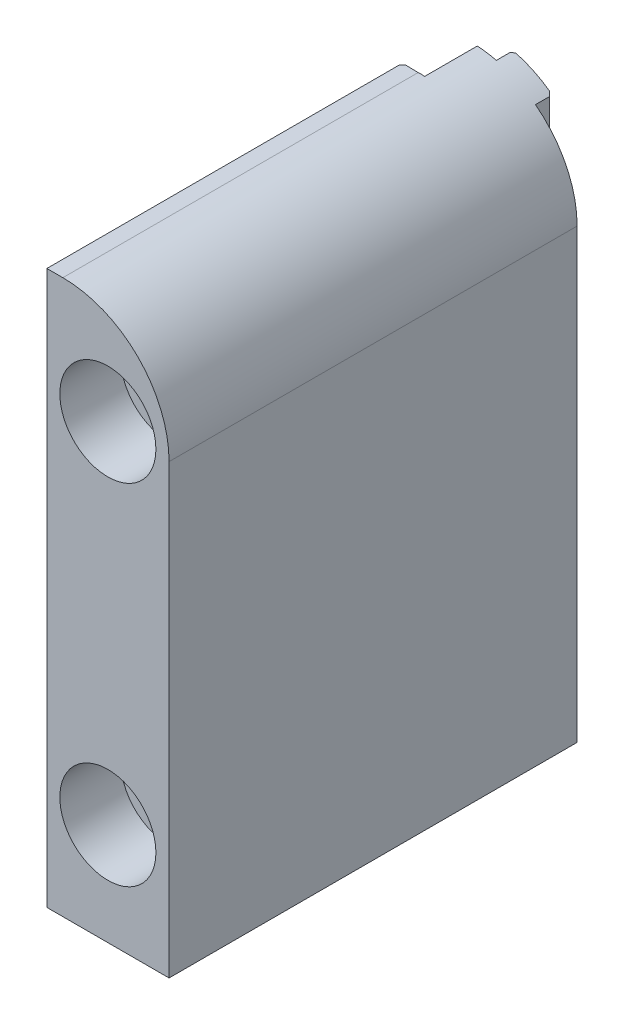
ISO-10303-21;
HEADER;
FILE_DESCRIPTION(('STEP AP214'),'2;1');
FILE_NAME('part.step','',(''),(''),'','','');
FILE_SCHEMA(('AUTOMOTIVE_DESIGN { 1 0 10303 214 1 1 1 1 }'));
ENDSEC;
DATA;
#1=APPLICATION_CONTEXT('core data for automotive mechanical design processes');
#2=APPLICATION_PROTOCOL_DEFINITION('international standard','automotive_design',2000,#1);
#3=PRODUCT_CONTEXT('',#1,'mechanical');
#4=PRODUCT('Part','Part','',(#3));
#5=PRODUCT_RELATED_PRODUCT_CATEGORY('part','',(#4));
#6=PRODUCT_DEFINITION_FORMATION('','',#4);
#7=PRODUCT_DEFINITION_CONTEXT('part definition',#1,'design');
#8=PRODUCT_DEFINITION('design','',#6,#7);
#9=PRODUCT_DEFINITION_SHAPE('','',#8);
#10=(LENGTH_UNIT() NAMED_UNIT(*) SI_UNIT(.MILLI.,.METRE.));
#11=(NAMED_UNIT(*) PLANE_ANGLE_UNIT() SI_UNIT($,.RADIAN.));
#12=(NAMED_UNIT(*) SI_UNIT($,.STERADIAN.) SOLID_ANGLE_UNIT());
#13=UNCERTAINTY_MEASURE_WITH_UNIT(LENGTH_MEASURE(1.E-05),#10,'distance_accuracy_value','');
#14=(GEOMETRIC_REPRESENTATION_CONTEXT(3) GLOBAL_UNCERTAINTY_ASSIGNED_CONTEXT((#13)) GLOBAL_UNIT_ASSIGNED_CONTEXT((#10,
#11,#12)) REPRESENTATION_CONTEXT('',''));
#15=CARTESIAN_POINT('',(0.,0.,0.));
#16=DIRECTION('',(0.,0.,1.));
#17=DIRECTION('',(1.,0.,0.));
#18=AXIS2_PLACEMENT_3D('',#15,#16,#17);
#19=CARTESIAN_POINT('',(7.32028,25.146,-37.084));
#20=DIRECTION('',(0.,0.,-1.));
#21=DIRECTION('',(-1.,0.,0.));
#22=AXIS2_PLACEMENT_3D('',#19,#20,#21);
#23=PLANE('',#22);
#24=CARTESIAN_POINT('',(5.54228,-15.875,-37.084));
#25=DIRECTION('',(0.,0.,1.));
#26=DIRECTION('',(1.,0.,0.));
#27=AXIS2_PLACEMENT_3D('',#24,#25,#26);
#28=CIRCLE('',#27,2.7051);
#29=CARTESIAN_POINT('',(8.24738,-15.875,-37.084));
#30=VERTEX_POINT('',#29);
#31=EDGE_CURVE('E457',#30,#30,#28,.T.);
#32=ORIENTED_EDGE('',*,*,#31,.T.);
#33=EDGE_LOOP('',(#32));
#34=FACE_BOUND('',#33,.T.);
#35=CARTESIAN_POINT('',(5.54228,15.875,-37.084));
#36=DIRECTION('',(0.,0.,1.));
#37=DIRECTION('',(1.,0.,0.));
#38=AXIS2_PLACEMENT_3D('',#35,#36,#37);
#39=CIRCLE('',#38,2.7051);
#40=CARTESIAN_POINT('',(8.24738,15.875,-37.084));
#41=VERTEX_POINT('',#40);
#42=EDGE_CURVE('E460',#41,#41,#39,.T.);
#43=ORIENTED_EDGE('',*,*,#42,.T.);
#44=EDGE_LOOP('',(#43));
#45=FACE_BOUND('',#44,.T.);
#46=DIRECTION('',(-0.999999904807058,0.000436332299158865,0.));
#47=VECTOR('',#46,1.);
#48=CARTESIAN_POINT('',(7.31623442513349,15.8742259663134,-37.084));
#49=LINE('',#48,#47);
#50=CARTESIAN_POINT('',(8.71753369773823,15.8736145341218,-37.084));
#51=VERTEX_POINT('',#50);
#52=CARTESIAN_POINT('',(8.71727969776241,15.8736146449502,-37.084));
#53=VERTEX_POINT('',#52);
#54=EDGE_CURVE('E252',#51,#53,#49,.T.);
#55=ORIENTED_EDGE('',*,*,#54,.T.);
#56=CARTESIAN_POINT('',(5.54228,15.875,-37.084));
#57=DIRECTION('',(0.,0.,-1.));
#58=DIRECTION('',(-1.,0.,0.));
#59=AXIS2_PLACEMENT_3D('',#56,#57,#58);
#60=CIRCLE('',#59,3.175);
#61=CARTESIAN_POINT('',(8.71728,15.875,-37.084));
#62=VERTEX_POINT('',#61);
#63=EDGE_CURVE('E296',#53,#62,#60,.T.);
#64=ORIENTED_EDGE('',*,*,#63,.T.);
#65=DIRECTION('',(-1.,0.,0.));
#66=VECTOR('',#65,1.);
#67=CARTESIAN_POINT('',(7.32028,15.875,-37.084));
#68=LINE('',#67,#66);
#69=CARTESIAN_POINT('',(8.717534,15.875,-37.084));
#70=VERTEX_POINT('',#69);
#71=EDGE_CURVE('E607',#62,#70,#68,.F.);
#72=ORIENTED_EDGE('',*,*,#71,.T.);
#73=CARTESIAN_POINT('',(5.54228,15.875,-37.084));
#74=DIRECTION('',(0.,0.,-1.));
#75=DIRECTION('',(-1.,0.,0.));
#76=AXIS2_PLACEMENT_3D('',#73,#74,#75);
#77=CIRCLE('',#76,3.175254);
#78=CARTESIAN_POINT('',(7.32028,18.5057706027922,-37.084));
#79=VERTEX_POINT('',#78);
#80=EDGE_CURVE('E588',#79,#70,#77,.T.);
#81=ORIENTED_EDGE('',*,*,#80,.F.);
#82=DIRECTION('',(0.,-1.,0.));
#83=VECTOR('',#82,1.);
#84=CARTESIAN_POINT('',(7.32028,25.146,-37.084));
#85=LINE('',#84,#83);
#86=CARTESIAN_POINT('',(7.32028,23.1578581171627,-37.084));
#87=VERTEX_POINT('',#86);
#88=EDGE_CURVE('E275',#87,#79,#85,.T.);
#89=ORIENTED_EDGE('',*,*,#88,.F.);
#90=CARTESIAN_POINT('',(1.45288,15.494,-37.084));
#91=DIRECTION('',(0.,0.,-1.));
#92=DIRECTION('',(-1.,0.,0.));
#93=AXIS2_PLACEMENT_3D('',#90,#91,#92);
#94=CIRCLE('',#93,9.652);
#95=CARTESIAN_POINT('',(11.10488,15.494,-37.084));
#96=VERTEX_POINT('',#95);
#97=EDGE_CURVE('E489',#87,#96,#94,.T.);
#98=ORIENTED_EDGE('',*,*,#97,.T.);
#99=DIRECTION('',(0.,-1.,0.));
#100=VECTOR('',#99,1.);
#101=CARTESIAN_POINT('',(11.10488,25.146,-37.084));
#102=LINE('',#101,#100);
#103=CARTESIAN_POINT('',(11.10488,-25.146,-37.084));
#104=VERTEX_POINT('',#103);
#105=EDGE_CURVE('E278',#96,#104,#102,.T.);
#106=ORIENTED_EDGE('',*,*,#105,.T.);
#107=DIRECTION('',(1.,0.,0.));
#108=VECTOR('',#107,1.);
#109=CARTESIAN_POINT('',(7.32028,-25.146,-37.084));
#110=LINE('',#109,#108);
#111=CARTESIAN_POINT('',(7.32028,-25.146,-37.084));
#112=VERTEX_POINT('',#111);
#113=EDGE_CURVE('E476',#112,#104,#110,.T.);
#114=ORIENTED_EDGE('',*,*,#113,.F.);
#115=CARTESIAN_POINT('',(7.32028,-18.5057706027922,-37.084));
#116=VERTEX_POINT('',#115);
#117=EDGE_CURVE('E276',#116,#112,#85,.T.);
#118=ORIENTED_EDGE('',*,*,#117,.F.);
#119=CARTESIAN_POINT('',(5.54228,-15.875,-37.084));
#120=DIRECTION('',(0.,0.,-1.));
#121=DIRECTION('',(-1.,0.,0.));
#122=AXIS2_PLACEMENT_3D('',#119,#120,#121);
#123=CIRCLE('',#122,3.175254);
#124=CARTESIAN_POINT('',(8.71753369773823,-15.8763854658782,-37.084));
#125=VERTEX_POINT('',#124);
#126=EDGE_CURVE('E425',#125,#116,#123,.T.);
#127=ORIENTED_EDGE('',*,*,#126,.F.);
#128=DIRECTION('',(-0.999999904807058,0.000436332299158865,0.));
#129=VECTOR('',#128,1.);
#130=CARTESIAN_POINT('',(7.30238087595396,-15.8757679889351,-37.084));
#131=LINE('',#130,#129);
#132=CARTESIAN_POINT('',(8.71727969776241,-15.8763853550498,-37.084));
#133=VERTEX_POINT('',#132);
#134=EDGE_CURVE('E444',#125,#133,#131,.T.);
#135=ORIENTED_EDGE('',*,*,#134,.T.);
#136=CARTESIAN_POINT('',(5.54228,-15.875,-37.084));
#137=DIRECTION('',(0.,0.,-1.));
#138=DIRECTION('',(-1.,0.,0.));
#139=AXIS2_PLACEMENT_3D('',#136,#137,#138);
#140=CIRCLE('',#139,3.175);
#141=CARTESIAN_POINT('',(8.71728,-15.875,-37.084));
#142=VERTEX_POINT('',#141);
#143=EDGE_CURVE('E455',#133,#142,#140,.T.);
#144=ORIENTED_EDGE('',*,*,#143,.T.);
#145=DIRECTION('',(-1.,0.,0.));
#146=VECTOR('',#145,1.);
#147=CARTESIAN_POINT('',(7.32028,-15.875,-37.084));
#148=LINE('',#147,#146);
#149=CARTESIAN_POINT('',(8.717534,-15.875,-37.084));
#150=VERTEX_POINT('',#149);
#151=EDGE_CURVE('E447',#142,#150,#148,.F.);
#152=ORIENTED_EDGE('',*,*,#151,.T.);
#153=CARTESIAN_POINT('',(7.32028,-13.2442293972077,-37.084));
#154=VERTEX_POINT('',#153);
#155=EDGE_CURVE('E424',#154,#150,#123,.T.);
#156=ORIENTED_EDGE('',*,*,#155,.F.);
#157=CARTESIAN_POINT('',(7.32028,13.2442293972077,-37.084));
#158=VERTEX_POINT('',#157);
#159=EDGE_CURVE('E19',#158,#154,#85,.T.);
#160=ORIENTED_EDGE('',*,*,#159,.F.);
#161=EDGE_CURVE('E591',#51,#158,#77,.T.);
#162=ORIENTED_EDGE('',*,*,#161,.F.);
#163=EDGE_LOOP('',(#55,#64,#72,#81,#89,#98,#106,#114,#118,#127,#135,#144,#152,#156,#160,#162));
#164=FACE_BOUND('',#163,.T.);
#165=ADVANCED_FACE('F15',(#34,#45,#164),#23,.T.);
#166=CARTESIAN_POINT('',(5.54228,15.875,-26.6446));
#167=DIRECTION('',(0.,0.,1.));
#168=DIRECTION('',(-1.,0.,0.));
#169=AXIS2_PLACEMENT_3D('',#166,#167,#168);
#170=CONICAL_SURFACE('',#169,3.3147,0.785398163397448);
#171=CARTESIAN_POINT('',(5.54228,15.875,-27.2542));
#172=DIRECTION('',(0.,0.,-1.));
#173=DIRECTION('',(-1.,0.,0.));
#174=AXIS2_PLACEMENT_3D('',#171,#172,#173);
#175=CIRCLE('',#174,2.7051);
#176=CARTESIAN_POINT('',(2.83718,15.875,-27.2542));
#177=VERTEX_POINT('',#176);
#178=EDGE_CURVE('E300',#177,#177,#175,.T.);
#179=ORIENTED_EDGE('',*,*,#178,.T.);
#180=EDGE_LOOP('',(#179));
#181=FACE_BOUND('',#180,.T.);
#182=CARTESIAN_POINT('',(5.54228,15.875,-26.6446));
#183=DIRECTION('',(0.,0.,1.));
#184=DIRECTION('',(1.,0.,0.));
#185=AXIS2_PLACEMENT_3D('',#182,#183,#184);
#186=CIRCLE('',#185,3.3147);
#187=CARTESIAN_POINT('',(8.85698,15.875,-26.6446));
#188=VERTEX_POINT('',#187);
#189=EDGE_CURVE('E333',#188,#188,#186,.T.);
#190=ORIENTED_EDGE('',*,*,#189,.T.);
#191=EDGE_LOOP('',(#190));
#192=FACE_BOUND('',#191,.T.);
#193=CARTESIAN_POINT('',(5.54228,15.875,-26.7843));
#194=DIRECTION('',(0.,0.,1.));
#195=DIRECTION('',(1.,0.,0.));
#196=AXIS2_PLACEMENT_3D('',#193,#194,#195);
#197=CIRCLE('',#196,3.175);
#198=CARTESIAN_POINT('',(8.71727969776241,15.8736146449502,-26.7843));
#199=VERTEX_POINT('',#198);
#200=CARTESIAN_POINT('',(8.71728,15.875,-26.7843));
#201=VERTEX_POINT('',#200);
#202=EDGE_CURVE('E9',#199,#201,#197,.F.);
#203=ORIENTED_EDGE('',*,*,#202,.F.);
#204=DIRECTION('',(0.707106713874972,-0.000308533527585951,0.707106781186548));
#205=VECTOR('',#204,1.);
#206=CARTESIAN_POINT('',(5.54228,15.875,-29.9593));
#207=LINE('',#206,#205);
#208=CARTESIAN_POINT('',(8.71753369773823,15.8736145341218,-26.784046));
#209=VERTEX_POINT('',#208);
#210=EDGE_CURVE('E244',#209,#199,#207,.F.);
#211=ORIENTED_EDGE('',*,*,#210,.F.);
#212=CARTESIAN_POINT('',(5.54228,15.875,-26.784046));
#213=DIRECTION('',(0.,0.,1.));
#214=DIRECTION('',(1.,0.,0.));
#215=AXIS2_PLACEMENT_3D('',#212,#213,#214);
#216=CIRCLE('',#215,3.175254);
#217=CARTESIAN_POINT('',(8.717534,15.875,-26.784046));
#218=VERTEX_POINT('',#217);
#219=EDGE_CURVE('E236',#209,#218,#216,.F.);
#220=ORIENTED_EDGE('',*,*,#219,.T.);
#221=DIRECTION('',(0.707106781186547,0.,0.707106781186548));
#222=VECTOR('',#221,1.);
#223=CARTESIAN_POINT('',(5.54228,15.875,-29.9593));
#224=LINE('',#223,#222);
#225=EDGE_CURVE('E25',#201,#218,#224,.T.);
#226=ORIENTED_EDGE('',*,*,#225,.F.);
#227=EDGE_LOOP('',(#203,#211,#220,#226));
#228=FACE_BOUND('',#227,.T.);
#229=ADVANCED_FACE('F255',(#181,#192,#228),#170,.F.);
#230=CARTESIAN_POINT('',(3.76428,13.2442293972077,-37.084));
#231=VERTEX_POINT('',#230);
#232=CARTESIAN_POINT('',(3.76428,18.5057706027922,-37.084));
#233=VERTEX_POINT('',#232);
#234=EDGE_CURVE('E592',#231,#233,#77,.T.);
#235=ORIENTED_EDGE('',*,*,#234,.F.);
#236=DIRECTION('',(0.,-1.,0.));
#237=VECTOR('',#236,1.);
#238=CARTESIAN_POINT('',(3.76428,25.146,-37.084));
#239=LINE('',#238,#237);
#240=CARTESIAN_POINT('',(3.76428,-13.2442293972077,-37.084));
#241=VERTEX_POINT('',#240);
#242=EDGE_CURVE('E259',#231,#241,#239,.T.);
#243=ORIENTED_EDGE('',*,*,#242,.T.);
#244=CARTESIAN_POINT('',(3.76428,-18.5057706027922,-37.084));
#245=VERTEX_POINT('',#244);
#246=EDGE_CURVE('E419',#245,#241,#123,.T.);
#247=ORIENTED_EDGE('',*,*,#246,.F.);
#248=CARTESIAN_POINT('',(3.76428,-25.146,-37.084));
#249=VERTEX_POINT('',#248);
#250=EDGE_CURVE('E262',#245,#249,#239,.T.);
#251=ORIENTED_EDGE('',*,*,#250,.T.);
#252=DIRECTION('',(1.,0.,0.));
#253=VECTOR('',#252,1.);
#254=CARTESIAN_POINT('',(1.96088,-25.146,-37.084));
#255=LINE('',#254,#253);
#256=CARTESIAN_POINT('',(2.02438,-25.146,-37.084));
#257=VERTEX_POINT('',#256);
#258=EDGE_CURVE('E324',#257,#249,#255,.T.);
#259=ORIENTED_EDGE('',*,*,#258,.F.);
#260=DIRECTION('',(0.,-1.,0.));
#261=VECTOR('',#260,1.);
#262=CARTESIAN_POINT('',(2.02438,25.146,-37.084));
#263=LINE('',#262,#261);
#264=CARTESIAN_POINT('',(2.032,25.1286107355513,-37.084));
#265=VERTEX_POINT('',#264);
#266=EDGE_CURVE('E309',#265,#257,#263,.T.);
#267=ORIENTED_EDGE('',*,*,#266,.F.);
#268=CARTESIAN_POINT('',(1.45288,15.494,-37.084));
#269=DIRECTION('',(0.,0.,-1.));
#270=DIRECTION('',(-1.,0.,0.));
#271=AXIS2_PLACEMENT_3D('',#268,#269,#270);
#272=CIRCLE('',#271,9.652);
#273=CARTESIAN_POINT('',(3.76428,24.8651543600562,-37.084));
#274=VERTEX_POINT('',#273);
#275=EDGE_CURVE('E315',#265,#274,#272,.T.);
#276=ORIENTED_EDGE('',*,*,#275,.T.);
#277=EDGE_CURVE('E261',#274,#233,#239,.T.);
#278=ORIENTED_EDGE('',*,*,#277,.T.);
#279=EDGE_LOOP('',(#235,#243,#247,#251,#259,#267,#276,#278));
#280=FACE_BOUND('',#279,.T.);
#281=ADVANCED_FACE('F612',(#280),#23,.T.);
#282=CARTESIAN_POINT('',(5.54228,-15.875,-26.6446));
#283=DIRECTION('',(0.,0.,1.));
#284=DIRECTION('',(-1.,0.,0.));
#285=AXIS2_PLACEMENT_3D('',#282,#283,#284);
#286=CONICAL_SURFACE('',#285,3.3147,0.785398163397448);
#287=CARTESIAN_POINT('',(5.54228,-15.875,-27.2542));
#288=DIRECTION('',(0.,0.,-1.));
#289=DIRECTION('',(-1.,0.,0.));
#290=AXIS2_PLACEMENT_3D('',#287,#288,#289);
#291=CIRCLE('',#290,2.7051);
#292=CARTESIAN_POINT('',(2.83718,-15.875,-27.2542));
#293=VERTEX_POINT('',#292);
#294=EDGE_CURVE('E330',#293,#293,#291,.T.);
#295=ORIENTED_EDGE('',*,*,#294,.T.);
#296=EDGE_LOOP('',(#295));
#297=FACE_BOUND('',#296,.T.);
#298=CARTESIAN_POINT('',(5.54228,-15.875,-26.6446));
#299=DIRECTION('',(0.,0.,1.));
#300=DIRECTION('',(1.,0.,0.));
#301=AXIS2_PLACEMENT_3D('',#298,#299,#300);
#302=CIRCLE('',#301,3.3147);
#303=CARTESIAN_POINT('',(8.85698,-15.875,-26.6446));
#304=VERTEX_POINT('',#303);
#305=EDGE_CURVE('E337',#304,#304,#302,.T.);
#306=ORIENTED_EDGE('',*,*,#305,.T.);
#307=EDGE_LOOP('',(#306));
#308=FACE_BOUND('',#307,.T.);
#309=CARTESIAN_POINT('',(5.54228,-15.875,-26.7843));
#310=DIRECTION('',(0.,0.,1.));
#311=DIRECTION('',(1.,0.,0.));
#312=AXIS2_PLACEMENT_3D('',#309,#310,#311);
#313=CIRCLE('',#312,3.175);
#314=CARTESIAN_POINT('',(8.71727969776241,-15.8763853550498,-26.7843));
#315=VERTEX_POINT('',#314);
#316=CARTESIAN_POINT('',(8.71728,-15.875,-26.7843));
#317=VERTEX_POINT('',#316);
#318=EDGE_CURVE('E245',#315,#317,#313,.F.);
#319=ORIENTED_EDGE('',*,*,#318,.F.);
#320=DIRECTION('',(0.707106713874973,-0.000308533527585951,0.707106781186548));
#321=VECTOR('',#320,1.);
#322=CARTESIAN_POINT('',(5.54228,-15.875,-29.9593));
#323=LINE('',#322,#321);
#324=CARTESIAN_POINT('',(8.71753369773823,-15.8763854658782,-26.784046));
#325=VERTEX_POINT('',#324);
#326=EDGE_CURVE('E283',#325,#315,#323,.F.);
#327=ORIENTED_EDGE('',*,*,#326,.F.);
#328=CARTESIAN_POINT('',(5.54228,-15.875,-26.784046));
#329=DIRECTION('',(0.,0.,1.));
#330=DIRECTION('',(1.,0.,0.));
#331=AXIS2_PLACEMENT_3D('',#328,#329,#330);
#332=CIRCLE('',#331,3.175254);
#333=CARTESIAN_POINT('',(8.717534,-15.875,-26.784046));
#334=VERTEX_POINT('',#333);
#335=EDGE_CURVE('E285',#325,#334,#332,.F.);
#336=ORIENTED_EDGE('',*,*,#335,.T.);
#337=DIRECTION('',(0.707106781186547,0.,0.707106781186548));
#338=VECTOR('',#337,1.);
#339=CARTESIAN_POINT('',(5.54228,-15.875,-29.9593));
#340=LINE('',#339,#338);
#341=EDGE_CURVE('E280',#317,#334,#340,.T.);
#342=ORIENTED_EDGE('',*,*,#341,.F.);
#343=EDGE_LOOP('',(#319,#327,#336,#342));
#344=FACE_BOUND('',#343,.T.);
#345=ADVANCED_FACE('F610',(#297,#308,#344),#286,.F.);
#346=CARTESIAN_POINT('',(3.76428,25.146,-37.084));
#347=DIRECTION('',(-1.,0.,0.));
#348=DIRECTION('',(0.,0.,1.));
#349=AXIS2_PLACEMENT_3D('',#346,#347,#348);
#350=PLANE('',#349);
#351=DIRECTION('',(0.,0.,1.));
#352=VECTOR('',#351,1.);
#353=CARTESIAN_POINT('',(3.76428,-18.5057706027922,-26.6446));
#354=LINE('',#353,#352);
#355=CARTESIAN_POINT('',(3.76428,-18.5057706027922,-38.354));
#356=VERTEX_POINT('',#355);
#357=EDGE_CURVE('E415',#356,#245,#354,.T.);
#358=ORIENTED_EDGE('',*,*,#357,.F.);
#359=DIRECTION('',(0.,1.,0.));
#360=VECTOR('',#359,1.);
#361=CARTESIAN_POINT('',(3.76428,25.146,-38.354));
#362=LINE('',#361,#360);
#363=CARTESIAN_POINT('',(3.76428,-25.146,-38.354));
#364=VERTEX_POINT('',#363);
#365=EDGE_CURVE('E350',#364,#356,#362,.T.);
#366=ORIENTED_EDGE('',*,*,#365,.F.);
#367=DIRECTION('',(0.,0.,-1.));
#368=VECTOR('',#367,1.);
#369=CARTESIAN_POINT('',(3.76428,-25.146,-37.084));
#370=LINE('',#369,#368);
#371=EDGE_CURVE('E414',#249,#364,#370,.T.);
#372=ORIENTED_EDGE('',*,*,#371,.F.);
#373=ORIENTED_EDGE('',*,*,#250,.F.);
#374=EDGE_LOOP('',(#358,#366,#372,#373));
#375=FACE_BOUND('',#374,.T.);
#376=ADVANCED_FACE('F412',(#375),#350,.T.);
#377=CARTESIAN_POINT('',(7.32028,25.146,-38.354));
#378=DIRECTION('',(-0.707106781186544,0.,0.707106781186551));
#379=DIRECTION('',(-0.707106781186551,0.,-0.707106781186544));
#380=AXIS2_PLACEMENT_3D('',#377,#378,#379);
#381=PLANE('',#380);
#382=CARTESIAN_POINT('',(5.54228,-15.875,-40.132));
#383=DIRECTION('',(-0.707106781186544,0.,0.707106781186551));
#384=DIRECTION('',(0.707106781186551,0.,0.707106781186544));
#385=AXIS2_PLACEMENT_3D('',#382,#383,#384);
#386=ELLIPSE('',#385,4.4904872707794,3.175254);
#387=CARTESIAN_POINT('',(7.32028,-18.5057706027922,-38.354));
#388=VERTEX_POINT('',#387);
#389=CARTESIAN_POINT('',(7.06628,-18.6606169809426,-38.608));
#390=VERTEX_POINT('',#389);
#391=EDGE_CURVE('E420',#388,#390,#386,.F.);
#392=ORIENTED_EDGE('',*,*,#391,.F.);
#393=DIRECTION('',(0.,-1.,0.));
#394=VECTOR('',#393,1.);
#395=CARTESIAN_POINT('',(7.32028,25.146,-38.354));
#396=LINE('',#395,#394);
#397=CARTESIAN_POINT('',(7.32028,-25.146,-38.354));
#398=VERTEX_POINT('',#397);
#399=EDGE_CURVE('E371',#388,#398,#396,.T.);
#400=ORIENTED_EDGE('',*,*,#399,.T.);
#401=DIRECTION('',(0.707106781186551,0.,0.707106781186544));
#402=VECTOR('',#401,1.);
#403=CARTESIAN_POINT('',(7.32028,-25.146,-38.354));
#404=LINE('',#403,#402);
#405=CARTESIAN_POINT('',(7.06628,-25.146,-38.608));
#406=VERTEX_POINT('',#405);
#407=EDGE_CURVE('E375',#398,#406,#404,.F.);
#408=ORIENTED_EDGE('',*,*,#407,.T.);
#409=DIRECTION('',(0.,1.,0.));
#410=VECTOR('',#409,1.);
#411=CARTESIAN_POINT('',(7.06628,25.146,-38.608));
#412=LINE('',#411,#410);
#413=EDGE_CURVE('E384',#406,#390,#412,.T.);
#414=ORIENTED_EDGE('',*,*,#413,.T.);
#415=EDGE_LOOP('',(#392,#400,#408,#414));
#416=FACE_BOUND('',#415,.T.);
#417=ADVANCED_FACE('F544',(#416),#381,.F.);
#418=CARTESIAN_POINT('',(3.76428,25.146,-38.608));
#419=DIRECTION('',(0.,0.,-1.));
#420=DIRECTION('',(-1.,0.,0.));
#421=AXIS2_PLACEMENT_3D('',#418,#419,#420);
#422=PLANE('',#421);
#423=CARTESIAN_POINT('',(5.54228,15.875,-38.608));
#424=DIRECTION('',(0.,0.,-1.));
#425=DIRECTION('',(-1.,0.,0.));
#426=AXIS2_PLACEMENT_3D('',#423,#424,#425);
#427=CIRCLE('',#426,3.175254);
#428=CARTESIAN_POINT('',(7.06628,13.0893830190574,-38.608));
#429=VERTEX_POINT('',#428);
#430=CARTESIAN_POINT('',(4.01828,13.0893830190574,-38.608));
#431=VERTEX_POINT('',#430);
#432=EDGE_CURVE('E600',#429,#431,#427,.T.);
#433=ORIENTED_EDGE('',*,*,#432,.F.);
#434=CARTESIAN_POINT('',(7.06628,-13.0893830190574,-38.608));
#435=VERTEX_POINT('',#434);
#436=EDGE_CURVE('E388',#435,#429,#412,.T.);
#437=ORIENTED_EDGE('',*,*,#436,.F.);
#438=CARTESIAN_POINT('',(5.54228,-15.875,-38.608));
#439=DIRECTION('',(0.,0.,-1.));
#440=DIRECTION('',(-1.,0.,0.));
#441=AXIS2_PLACEMENT_3D('',#438,#439,#440);
#442=CIRCLE('',#441,3.175254);
#443=CARTESIAN_POINT('',(4.01828,-13.0893830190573,-38.608));
#444=VERTEX_POINT('',#443);
#445=EDGE_CURVE('E436',#444,#435,#442,.T.);
#446=ORIENTED_EDGE('',*,*,#445,.F.);
#447=DIRECTION('',(0.,-1.,0.));
#448=VECTOR('',#447,1.);
#449=CARTESIAN_POINT('',(4.01828,25.146,-38.608));
#450=LINE('',#449,#448);
#451=EDGE_CURVE('E383',#431,#444,#450,.T.);
#452=ORIENTED_EDGE('',*,*,#451,.F.);
#453=EDGE_LOOP('',(#433,#437,#446,#452));
#454=FACE_BOUND('',#453,.T.);
#455=ADVANCED_FACE('F644',(#454),#422,.T.);
#456=CARTESIAN_POINT('',(7.32028,25.146,-38.608));
#457=DIRECTION('',(1.,0.,0.));
#458=DIRECTION('',(0.,0.,-1.));
#459=AXIS2_PLACEMENT_3D('',#456,#457,#458);
#460=PLANE('',#459);
#461=DIRECTION('',(0.,0.,1.));
#462=VECTOR('',#461,1.);
#463=CARTESIAN_POINT('',(7.32028,13.2442293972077,-26.6446));
#464=LINE('',#463,#462);
#465=CARTESIAN_POINT('',(7.32028,13.2442293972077,-38.354));
#466=VERTEX_POINT('',#465);
#467=EDGE_CURVE('E604',#158,#466,#464,.F.);
#468=ORIENTED_EDGE('',*,*,#467,.F.);
#469=ORIENTED_EDGE('',*,*,#159,.T.);
#470=DIRECTION('',(0.,0.,1.));
#471=VECTOR('',#470,1.);
#472=CARTESIAN_POINT('',(7.32028,-13.2442293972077,-26.6446));
#473=LINE('',#472,#471);
#474=CARTESIAN_POINT('',(7.32028,-13.2442293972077,-38.354));
#475=VERTEX_POINT('',#474);
#476=EDGE_CURVE('E441',#475,#154,#473,.T.);
#477=ORIENTED_EDGE('',*,*,#476,.F.);
#478=EDGE_CURVE('E370',#466,#475,#396,.T.);
#479=ORIENTED_EDGE('',*,*,#478,.F.);
#480=EDGE_LOOP('',(#468,#469,#477,#479));
#481=FACE_BOUND('',#480,.T.);
#482=ADVANCED_FACE('F642',(#481),#460,.T.);
#483=CARTESIAN_POINT('',(4.01828,25.146,-38.608));
#484=DIRECTION('',(0.707106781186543,0.,0.707106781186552));
#485=DIRECTION('',(-0.707106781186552,0.,0.707106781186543));
#486=AXIS2_PLACEMENT_3D('',#483,#484,#485);
#487=PLANE('',#486);
#488=CARTESIAN_POINT('',(5.54228,15.875,-40.132));
#489=DIRECTION('',(0.707106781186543,0.,0.707106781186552));
#490=DIRECTION('',(-0.707106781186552,0.,0.707106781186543));
#491=AXIS2_PLACEMENT_3D('',#488,#489,#490);
#492=ELLIPSE('',#491,4.4904872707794,3.175254);
#493=CARTESIAN_POINT('',(3.76428,13.2442293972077,-38.354));
#494=VERTEX_POINT('',#493);
#495=EDGE_CURVE('E598',#431,#494,#492,.F.);
#496=ORIENTED_EDGE('',*,*,#495,.F.);
#497=ORIENTED_EDGE('',*,*,#451,.T.);
#498=CARTESIAN_POINT('',(5.54228,-15.875,-40.132));
#499=DIRECTION('',(0.707106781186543,0.,0.707106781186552));
#500=DIRECTION('',(-0.707106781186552,0.,0.707106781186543));
#501=AXIS2_PLACEMENT_3D('',#498,#499,#500);
#502=ELLIPSE('',#501,4.49048727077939,3.175254);
#503=CARTESIAN_POINT('',(3.76428,-13.2442293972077,-38.354));
#504=VERTEX_POINT('',#503);
#505=EDGE_CURVE('E433',#504,#444,#502,.F.);
#506=ORIENTED_EDGE('',*,*,#505,.F.);
#507=EDGE_CURVE('E394',#504,#494,#362,.T.);
#508=ORIENTED_EDGE('',*,*,#507,.T.);
#509=EDGE_LOOP('',(#496,#497,#506,#508));
#510=FACE_BOUND('',#509,.T.);
#511=ADVANCED_FACE('F706',(#510),#487,.F.);
#512=DIRECTION('',(0.,0.,1.));
#513=VECTOR('',#512,1.);
#514=CARTESIAN_POINT('',(3.76428,13.2442293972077,-26.6446));
#515=LINE('',#514,#513);
#516=EDGE_CURVE('E596',#494,#231,#515,.T.);
#517=ORIENTED_EDGE('',*,*,#516,.F.);
#518=ORIENTED_EDGE('',*,*,#507,.F.);
#519=DIRECTION('',(0.,0.,1.));
#520=VECTOR('',#519,1.);
#521=CARTESIAN_POINT('',(3.76428,-13.2442293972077,-26.6446));
#522=LINE('',#521,#520);
#523=EDGE_CURVE('E431',#241,#504,#522,.F.);
#524=ORIENTED_EDGE('',*,*,#523,.F.);
#525=ORIENTED_EDGE('',*,*,#242,.F.);
#526=EDGE_LOOP('',(#517,#518,#524,#525));
#527=FACE_BOUND('',#526,.T.);
#528=ADVANCED_FACE('F621',(#527),#350,.T.);
#529=CARTESIAN_POINT('',(5.54228,15.875,-38.608));
#530=DIRECTION('',(0.,0.,-1.));
#531=DIRECTION('',(-1.,0.,0.));
#532=AXIS2_PLACEMENT_3D('',#529,#530,#531);
#533=CIRCLE('',#532,3.175254);
#534=CARTESIAN_POINT('',(4.01828,18.6606169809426,-38.608));
#535=VERTEX_POINT('',#534);
#536=CARTESIAN_POINT('',(7.06628,18.6606169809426,-38.608));
#537=VERTEX_POINT('',#536);
#538=EDGE_CURVE('E33',#535,#537,#533,.T.);
#539=ORIENTED_EDGE('',*,*,#538,.F.);
#540=CARTESIAN_POINT('',(4.01828,24.7988281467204,-38.608));
#541=VERTEX_POINT('',#540);
#542=EDGE_CURVE('E379',#541,#535,#450,.T.);
#543=ORIENTED_EDGE('',*,*,#542,.F.);
#544=CARTESIAN_POINT('',(1.45288,15.494,-38.608));
#545=DIRECTION('',(0.,0.,-1.));
#546=DIRECTION('',(-1.,0.,0.));
#547=AXIS2_PLACEMENT_3D('',#544,#545,#546);
#548=CIRCLE('',#547,9.652);
#549=CARTESIAN_POINT('',(7.06628,23.3458051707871,-38.608));
#550=VERTEX_POINT('',#549);
#551=EDGE_CURVE('E548',#541,#550,#548,.T.);
#552=ORIENTED_EDGE('',*,*,#551,.T.);
#553=EDGE_CURVE('E382',#537,#550,#412,.T.);
#554=ORIENTED_EDGE('',*,*,#553,.F.);
#555=EDGE_LOOP('',(#539,#543,#552,#554));
#556=FACE_BOUND('',#555,.T.);
#557=ADVANCED_FACE('F566',(#556),#422,.T.);
#558=DIRECTION('',(0.,0.,1.));
#559=VECTOR('',#558,1.);
#560=CARTESIAN_POINT('',(7.32028,18.5057706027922,-26.6446));
#561=LINE('',#560,#559);
#562=CARTESIAN_POINT('',(7.32028,18.5057706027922,-38.354));
#563=VERTEX_POINT('',#562);
#564=EDGE_CURVE('E576',#563,#79,#561,.T.);
#565=ORIENTED_EDGE('',*,*,#564,.F.);
#566=CARTESIAN_POINT('',(7.32028,23.1578581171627,-38.354));
#567=VERTEX_POINT('',#566);
#568=EDGE_CURVE('E366',#567,#563,#396,.T.);
#569=ORIENTED_EDGE('',*,*,#568,.F.);
#570=DIRECTION('',(0.,0.,1.));
#571=VECTOR('',#570,1.);
#572=CARTESIAN_POINT('',(7.32028,23.1578581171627,-38.608));
#573=LINE('',#572,#571);
#574=EDGE_CURVE('E545',#567,#87,#573,.T.);
#575=ORIENTED_EDGE('',*,*,#574,.T.);
#576=ORIENTED_EDGE('',*,*,#88,.T.);
#577=EDGE_LOOP('',(#565,#569,#575,#576));
#578=FACE_BOUND('',#577,.T.);
#579=ADVANCED_FACE('F575',(#578),#460,.T.);
#580=CARTESIAN_POINT('',(5.54228,15.875,-40.132));
#581=DIRECTION('',(-0.707106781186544,0.,0.707106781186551));
#582=DIRECTION('',(0.707106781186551,0.,0.707106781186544));
#583=AXIS2_PLACEMENT_3D('',#580,#581,#582);
#584=ELLIPSE('',#583,4.4904872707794,3.175254);
#585=EDGE_CURVE('E602',#466,#429,#584,.F.);
#586=ORIENTED_EDGE('',*,*,#585,.F.);
#587=ORIENTED_EDGE('',*,*,#478,.T.);
#588=CARTESIAN_POINT('',(5.54228,-15.875,-40.132));
#589=DIRECTION('',(-0.707106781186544,0.,0.707106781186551));
#590=DIRECTION('',(0.707106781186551,0.,0.707106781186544));
#591=AXIS2_PLACEMENT_3D('',#588,#589,#590);
#592=ELLIPSE('',#591,4.4904872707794,3.175254);
#593=EDGE_CURVE('E438',#435,#475,#592,.F.);
#594=ORIENTED_EDGE('',*,*,#593,.F.);
#595=ORIENTED_EDGE('',*,*,#436,.T.);
#596=EDGE_LOOP('',(#586,#587,#594,#595));
#597=FACE_BOUND('',#596,.T.);
#598=ADVANCED_FACE('F716',(#597),#381,.F.);
#599=CARTESIAN_POINT('',(5.54228,15.875,-40.132));
#600=DIRECTION('',(0.707106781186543,0.,0.707106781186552));
#601=DIRECTION('',(-0.707106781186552,0.,0.707106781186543));
#602=AXIS2_PLACEMENT_3D('',#599,#600,#601);
#603=ELLIPSE('',#602,4.4904872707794,3.175254);
#604=CARTESIAN_POINT('',(3.76428,18.5057706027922,-38.354));
#605=VERTEX_POINT('',#604);
#606=EDGE_CURVE('E590',#605,#535,#603,.F.);
#607=ORIENTED_EDGE('',*,*,#606,.F.);
#608=CARTESIAN_POINT('',(3.76428,24.8651543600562,-38.354));
#609=VERTEX_POINT('',#608);
#610=EDGE_CURVE('E390',#605,#609,#362,.T.);
#611=ORIENTED_EDGE('',*,*,#610,.T.);
#612=CARTESIAN_POINT('',(1.45288,15.494,-36.0426));
#613=DIRECTION('',(-0.707106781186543,0.,-0.707106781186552));
#614=DIRECTION('',(-0.707106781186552,0.,0.707106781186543));
#615=AXIS2_PLACEMENT_3D('',#612,#613,#614);
#616=ELLIPSE('',#615,13.649989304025,9.652);
#617=EDGE_CURVE('E387',#609,#541,#616,.T.);
#618=ORIENTED_EDGE('',*,*,#617,.T.);
#619=ORIENTED_EDGE('',*,*,#542,.T.);
#620=EDGE_LOOP('',(#607,#611,#618,#619));
#621=FACE_BOUND('',#620,.T.);
#622=ADVANCED_FACE('F656',(#621),#487,.F.);
#623=CARTESIAN_POINT('',(11.10488,25.146,-37.084));
#624=DIRECTION('',(1.,0.,0.));
#625=DIRECTION('',(0.,0.,-1.));
#626=AXIS2_PLACEMENT_3D('',#623,#624,#625);
#627=PLANE('',#626);
#628=DIRECTION('',(0.,0.,1.));
#629=VECTOR('',#628,1.);
#630=CARTESIAN_POINT('',(11.10488,15.494,-37.084));
#631=LINE('',#630,#629);
#632=CARTESIAN_POINT('',(11.10488,15.494,0.));
#633=VERTEX_POINT('',#632);
#634=EDGE_CURVE('E555',#96,#633,#631,.T.);
#635=ORIENTED_EDGE('',*,*,#634,.T.);
#636=DIRECTION('',(0.,-1.,0.));
#637=VECTOR('',#636,1.);
#638=CARTESIAN_POINT('',(11.10488,25.146,0.));
#639=LINE('',#638,#637);
#640=CARTESIAN_POINT('',(11.10488,-25.146,0.));
#641=VERTEX_POINT('',#640);
#642=EDGE_CURVE('E267',#633,#641,#639,.T.);
#643=ORIENTED_EDGE('',*,*,#642,.T.);
#644=DIRECTION('',(0.,0.,1.));
#645=VECTOR('',#644,1.);
#646=CARTESIAN_POINT('',(11.10488,-25.146,-37.084));
#647=LINE('',#646,#645);
#648=EDGE_CURVE('E463',#104,#641,#647,.T.);
#649=ORIENTED_EDGE('',*,*,#648,.F.);
#650=ORIENTED_EDGE('',*,*,#105,.F.);
#651=EDGE_LOOP('',(#635,#643,#649,#650));
#652=FACE_BOUND('',#651,.T.);
#653=ADVANCED_FACE('F494',(#652),#627,.T.);
#654=CARTESIAN_POINT('',(11.10488,25.146,0.));
#655=DIRECTION('',(0.,0.,1.));
#656=DIRECTION('',(1.,0.,0.));
#657=AXIS2_PLACEMENT_3D('',#654,#655,#656);
#658=PLANE('',#657);
#659=CARTESIAN_POINT('',(5.54228,-15.875,0.));
#660=DIRECTION('',(0.,0.,1.));
#661=DIRECTION('',(1.,0.,0.));
#662=AXIS2_PLACEMENT_3D('',#659,#660,#661);
#663=CIRCLE('',#662,4.365625);
#664=CARTESIAN_POINT('',(9.907905,-15.875,0.));
#665=VERTEX_POINT('',#664);
#666=EDGE_CURVE('E297',#665,#665,#663,.T.);
#667=ORIENTED_EDGE('',*,*,#666,.F.);
#668=EDGE_LOOP('',(#667));
#669=FACE_BOUND('',#668,.T.);
#670=CARTESIAN_POINT('',(5.54228,15.875,0.));
#671=DIRECTION('',(0.,0.,1.));
#672=DIRECTION('',(1.,0.,0.));
#673=AXIS2_PLACEMENT_3D('',#670,#671,#672);
#674=CIRCLE('',#673,4.365625);
#675=CARTESIAN_POINT('',(9.907905,15.875,0.));
#676=VERTEX_POINT('',#675);
#677=EDGE_CURVE('E289',#676,#676,#674,.T.);
#678=ORIENTED_EDGE('',*,*,#677,.F.);
#679=EDGE_LOOP('',(#678));
#680=FACE_BOUND('',#679,.T.);
#681=ORIENTED_EDGE('',*,*,#642,.F.);
#682=CARTESIAN_POINT('',(1.45288,15.494,0.));
#683=DIRECTION('',(0.,0.,1.));
#684=DIRECTION('',(1.,0.,0.));
#685=AXIS2_PLACEMENT_3D('',#682,#683,#684);
#686=CIRCLE('',#685,9.652);
#687=CARTESIAN_POINT('',(1.45288,25.146,0.));
#688=VERTEX_POINT('',#687);
#689=EDGE_CURVE('E556',#633,#688,#686,.T.);
#690=ORIENTED_EDGE('',*,*,#689,.T.);
#691=DIRECTION('',(-1.,0.,0.));
#692=VECTOR('',#691,1.);
#693=CARTESIAN_POINT('',(11.10488,25.146,0.));
#694=LINE('',#693,#692);
#695=CARTESIAN_POINT('',(0.,25.146,0.));
#696=VERTEX_POINT('',#695);
#697=EDGE_CURVE('E478',#688,#696,#694,.T.);
#698=ORIENTED_EDGE('',*,*,#697,.T.);
#699=DIRECTION('',(0.,-1.,0.));
#700=VECTOR('',#699,1.);
#701=CARTESIAN_POINT('',(0.,25.146,0.));
#702=LINE('',#701,#700);
#703=CARTESIAN_POINT('',(0.,-25.146,0.));
#704=VERTEX_POINT('',#703);
#705=EDGE_CURVE('E308',#696,#704,#702,.T.);
#706=ORIENTED_EDGE('',*,*,#705,.T.);
#707=DIRECTION('',(-1.,0.,0.));
#708=VECTOR('',#707,1.);
#709=CARTESIAN_POINT('',(11.10488,-25.146,0.));
#710=LINE('',#709,#708);
#711=EDGE_CURVE('E464',#641,#704,#710,.T.);
#712=ORIENTED_EDGE('',*,*,#711,.F.);
#713=EDGE_LOOP('',(#681,#690,#698,#706,#712));
#714=FACE_BOUND('',#713,.T.);
#715=ADVANCED_FACE('F649',(#669,#680,#714),#658,.T.);
#716=CARTESIAN_POINT('',(0.,25.146,0.));
#717=DIRECTION('',(-1.,0.,0.));
#718=DIRECTION('',(0.,0.,1.));
#719=AXIS2_PLACEMENT_3D('',#716,#717,#718);
#720=PLANE('',#719);
#721=DIRECTION('',(0.,0.,-1.));
#722=VECTOR('',#721,1.);
#723=CARTESIAN_POINT('',(0.,-25.146,-32.29356));
#724=LINE('',#723,#722);
#725=CARTESIAN_POINT('',(0.,-25.146,-32.0548));
#726=VERTEX_POINT('',#725);
#727=EDGE_CURVE('E467',#704,#726,#724,.T.);
#728=ORIENTED_EDGE('',*,*,#727,.F.);
#729=ORIENTED_EDGE('',*,*,#705,.F.);
#730=DIRECTION('',(0.,0.,-1.));
#731=VECTOR('',#730,1.);
#732=CARTESIAN_POINT('',(0.,25.146,-32.29356));
#733=LINE('',#732,#731);
#734=CARTESIAN_POINT('',(0.,25.146,-32.0548));
#735=VERTEX_POINT('',#734);
#736=EDGE_CURVE('E355',#696,#735,#733,.T.);
#737=ORIENTED_EDGE('',*,*,#736,.T.);
#738=DIRECTION('',(0.,1.,0.));
#739=VECTOR('',#738,1.);
#740=CARTESIAN_POINT('',(0.,25.146,-32.0548));
#741=LINE('',#740,#739);
#742=EDGE_CURVE('E344',#726,#735,#741,.T.);
#743=ORIENTED_EDGE('',*,*,#742,.F.);
#744=EDGE_LOOP('',(#728,#729,#737,#743));
#745=FACE_BOUND('',#744,.T.);
#746=ADVANCED_FACE('F652',(#745),#720,.T.);
#747=CARTESIAN_POINT('',(-0.00380999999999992,25.146,-32.3088));
#748=DIRECTION('',(0.,0.,-1.));
#749=DIRECTION('',(-1.,0.,0.));
#750=AXIS2_PLACEMENT_3D('',#747,#748,#749);
#751=PLANE('',#750);
#752=DIRECTION('',(1.,0.,0.));
#753=VECTOR('',#752,1.);
#754=CARTESIAN_POINT('',(11.10488,25.146,-32.3088));
#755=LINE('',#754,#753);
#756=CARTESIAN_POINT('',(0.254,25.146,-32.3088));
#757=VERTEX_POINT('',#756);
#758=CARTESIAN_POINT('',(1.45288,25.146,-32.29356));
#759=VERTEX_POINT('',#758);
#760=EDGE_CURVE('E351',#757,#759,#755,.T.);
#761=ORIENTED_EDGE('',*,*,#760,.T.);
#762=CARTESIAN_POINT('',(1.45288,15.494,-32.3088));
#763=DIRECTION('',(0.,0.,1.));
#764=DIRECTION('',(1.,0.,0.));
#765=AXIS2_PLACEMENT_3D('',#762,#763,#764);
#766=CIRCLE('',#765,9.652);
#767=CARTESIAN_POINT('',(2.032,25.1286107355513,-32.29356));
#768=VERTEX_POINT('',#767);
#769=EDGE_CURVE('E316',#759,#768,#766,.F.);
#770=ORIENTED_EDGE('',*,*,#769,.T.);
#771=DIRECTION('',(0.,-1.,0.));
#772=VECTOR('',#771,1.);
#773=CARTESIAN_POINT('',(2.02438,25.146,-32.3088));
#774=LINE('',#773,#772);
#775=CARTESIAN_POINT('',(2.02438,-25.146,-32.3088));
#776=VERTEX_POINT('',#775);
#777=EDGE_CURVE('E305',#768,#776,#774,.T.);
#778=ORIENTED_EDGE('',*,*,#777,.T.);
#779=DIRECTION('',(1.,0.,0.));
#780=VECTOR('',#779,1.);
#781=CARTESIAN_POINT('',(11.10488,-25.146,-32.3088));
#782=LINE('',#781,#780);
#783=CARTESIAN_POINT('',(0.254,-25.146,-32.3088));
#784=VERTEX_POINT('',#783);
#785=EDGE_CURVE('E325',#784,#776,#782,.T.);
#786=ORIENTED_EDGE('',*,*,#785,.F.);
#787=DIRECTION('',(0.,-1.,0.));
#788=VECTOR('',#787,1.);
#789=CARTESIAN_POINT('',(0.254,25.146,-32.3088));
#790=LINE('',#789,#788);
#791=EDGE_CURVE('E347',#757,#784,#790,.T.);
#792=ORIENTED_EDGE('',*,*,#791,.F.);
#793=EDGE_LOOP('',(#761,#770,#778,#786,#792));
#794=FACE_BOUND('',#793,.T.);
#795=ADVANCED_FACE('F659',(#794),#751,.T.);
#796=CARTESIAN_POINT('',(2.02438,25.146,-32.29356));
#797=DIRECTION('',(-1.,0.,0.));
#798=DIRECTION('',(0.,0.,1.));
#799=AXIS2_PLACEMENT_3D('',#796,#797,#798);
#800=PLANE('',#799);
#801=DIRECTION('',(0.,0.,-1.));
#802=VECTOR('',#801,1.);
#803=CARTESIAN_POINT('',(2.02438,-25.146,-32.29356));
#804=LINE('',#803,#802);
#805=EDGE_CURVE('E321',#776,#257,#804,.T.);
#806=ORIENTED_EDGE('',*,*,#805,.F.);
#807=ORIENTED_EDGE('',*,*,#777,.F.);
#808=DIRECTION('',(0.,0.,1.));
#809=VECTOR('',#808,1.);
#810=CARTESIAN_POINT('',(2.02438,25.1290657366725,-32.29356));
#811=LINE('',#810,#809);
#812=EDGE_CURVE('E312',#768,#265,#811,.F.);
#813=ORIENTED_EDGE('',*,*,#812,.T.);
#814=ORIENTED_EDGE('',*,*,#266,.T.);
#815=EDGE_LOOP('',(#806,#807,#813,#814));
#816=FACE_BOUND('',#815,.T.);
#817=ADVANCED_FACE('F647',(#816),#800,.T.);
#818=DIRECTION('',(0.,0.,1.));
#819=VECTOR('',#818,1.);
#820=CARTESIAN_POINT('',(3.76428,18.5057706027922,-26.6446));
#821=LINE('',#820,#819);
#822=EDGE_CURVE('E594',#233,#605,#821,.F.);
#823=ORIENTED_EDGE('',*,*,#822,.F.);
#824=ORIENTED_EDGE('',*,*,#277,.F.);
#825=DIRECTION('',(0.,0.,1.));
#826=VECTOR('',#825,1.);
#827=CARTESIAN_POINT('',(3.76428,24.8651543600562,-37.084));
#828=LINE('',#827,#826);
#829=EDGE_CURVE('E329',#274,#609,#828,.F.);
#830=ORIENTED_EDGE('',*,*,#829,.T.);
#831=ORIENTED_EDGE('',*,*,#610,.F.);
#832=EDGE_LOOP('',(#823,#824,#830,#831));
#833=FACE_BOUND('',#832,.T.);
#834=ADVANCED_FACE('F622',(#833),#350,.T.);
#835=CARTESIAN_POINT('',(5.54228,-15.875,-38.608));
#836=DIRECTION('',(0.,0.,-1.));
#837=DIRECTION('',(-1.,0.,0.));
#838=AXIS2_PLACEMENT_3D('',#835,#836,#837);
#839=CIRCLE('',#838,3.175254);
#840=CARTESIAN_POINT('',(4.01828,-18.6606169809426,-38.608));
#841=VERTEX_POINT('',#840);
#842=EDGE_CURVE('E426',#390,#841,#839,.T.);
#843=ORIENTED_EDGE('',*,*,#842,.F.);
#844=ORIENTED_EDGE('',*,*,#413,.F.);
#845=DIRECTION('',(1.,0.,0.));
#846=VECTOR('',#845,1.);
#847=CARTESIAN_POINT('',(3.76428,-25.146,-38.608));
#848=LINE('',#847,#846);
#849=CARTESIAN_POINT('',(4.01828,-25.146,-38.608));
#850=VERTEX_POINT('',#849);
#851=EDGE_CURVE('E471',#850,#406,#848,.T.);
#852=ORIENTED_EDGE('',*,*,#851,.F.);
#853=EDGE_CURVE('E378',#841,#850,#450,.T.);
#854=ORIENTED_EDGE('',*,*,#853,.F.);
#855=EDGE_LOOP('',(#843,#844,#852,#854));
#856=FACE_BOUND('',#855,.T.);
#857=ADVANCED_FACE('F541',(#856),#422,.T.);
#858=DIRECTION('',(0.,0.,1.));
#859=VECTOR('',#858,1.);
#860=CARTESIAN_POINT('',(7.32028,-18.5057706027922,-26.6446));
#861=LINE('',#860,#859);
#862=EDGE_CURVE('E422',#116,#388,#861,.F.);
#863=ORIENTED_EDGE('',*,*,#862,.F.);
#864=ORIENTED_EDGE('',*,*,#117,.T.);
#865=DIRECTION('',(0.,0.,1.));
#866=VECTOR('',#865,1.);
#867=CARTESIAN_POINT('',(7.32028,-25.146,-38.608));
#868=LINE('',#867,#866);
#869=EDGE_CURVE('E473',#398,#112,#868,.T.);
#870=ORIENTED_EDGE('',*,*,#869,.F.);
#871=ORIENTED_EDGE('',*,*,#399,.F.);
#872=EDGE_LOOP('',(#863,#864,#870,#871));
#873=FACE_BOUND('',#872,.T.);
#874=ADVANCED_FACE('F505',(#873),#460,.T.);
#875=CARTESIAN_POINT('',(11.10488,25.146,-32.29356));
#876=DIRECTION('',(0.,1.,0.));
#877=DIRECTION('',(0.,0.,1.));
#878=AXIS2_PLACEMENT_3D('',#875,#876,#877);
#879=PLANE('',#878);
#880=ORIENTED_EDGE('',*,*,#736,.F.);
#881=ORIENTED_EDGE('',*,*,#697,.F.);
#882=DIRECTION('',(0.,0.,1.));
#883=VECTOR('',#882,1.);
#884=CARTESIAN_POINT('',(1.45288,25.146,-32.29356));
#885=LINE('',#884,#883);
#886=EDGE_CURVE('E363',#688,#759,#885,.F.);
#887=ORIENTED_EDGE('',*,*,#886,.T.);
#888=ORIENTED_EDGE('',*,*,#760,.F.);
#889=DIRECTION('',(-0.707106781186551,0.,0.707106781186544));
#890=VECTOR('',#889,1.);
#891=CARTESIAN_POINT('',(5.67182,25.146,-37.72662));
#892=LINE('',#891,#890);
#893=EDGE_CURVE('E288',#735,#757,#892,.F.);
#894=ORIENTED_EDGE('',*,*,#893,.F.);
#895=EDGE_LOOP('',(#880,#881,#887,#888,#894));
#896=FACE_BOUND('',#895,.T.);
#897=ADVANCED_FACE('F638',(#896),#879,.T.);
#898=CARTESIAN_POINT('',(11.10488,-25.146,-32.29356));
#899=DIRECTION('',(0.,1.,0.));
#900=DIRECTION('',(0.,0.,1.));
#901=AXIS2_PLACEMENT_3D('',#898,#899,#900);
#902=PLANE('',#901);
#903=ORIENTED_EDGE('',*,*,#869,.T.);
#904=ORIENTED_EDGE('',*,*,#113,.T.);
#905=ORIENTED_EDGE('',*,*,#648,.T.);
#906=ORIENTED_EDGE('',*,*,#711,.T.);
#907=ORIENTED_EDGE('',*,*,#727,.T.);
#908=DIRECTION('',(0.707106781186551,0.,-0.707106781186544));
#909=VECTOR('',#908,1.);
#910=CARTESIAN_POINT('',(0.254,-25.146,-32.3088));
#911=LINE('',#910,#909);
#912=EDGE_CURVE('E369',#784,#726,#911,.F.);
#913=ORIENTED_EDGE('',*,*,#912,.F.);
#914=ORIENTED_EDGE('',*,*,#785,.T.);
#915=ORIENTED_EDGE('',*,*,#805,.T.);
#916=ORIENTED_EDGE('',*,*,#258,.T.);
#917=ORIENTED_EDGE('',*,*,#371,.T.);
#918=DIRECTION('',(0.707106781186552,0.,-0.707106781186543));
#919=VECTOR('',#918,1.);
#920=CARTESIAN_POINT('',(4.01828,-25.146,-38.608));
#921=LINE('',#920,#919);
#922=EDGE_CURVE('E373',#850,#364,#921,.F.);
#923=ORIENTED_EDGE('',*,*,#922,.F.);
#924=ORIENTED_EDGE('',*,*,#851,.T.);
#925=ORIENTED_EDGE('',*,*,#407,.F.);
#926=EDGE_LOOP('',(#903,#904,#905,#906,#907,#913,#914,#915,#916,#917,#923,#924,#925));
#927=FACE_BOUND('',#926,.T.);
#928=ADVANCED_FACE('F497',(#927),#902,.F.);
#929=CARTESIAN_POINT('',(1.45288,15.494,-37.084));
#930=DIRECTION('',(0.,0.,1.));
#931=DIRECTION('',(0.,-1.,0.));
#932=AXIS2_PLACEMENT_3D('',#929,#930,#931);
#933=CYLINDRICAL_SURFACE('',#932,9.652);
#934=ORIENTED_EDGE('',*,*,#551,.F.);
#935=ORIENTED_EDGE('',*,*,#617,.F.);
#936=ORIENTED_EDGE('',*,*,#829,.F.);
#937=ORIENTED_EDGE('',*,*,#275,.F.);
#938=ORIENTED_EDGE('',*,*,#812,.F.);
#939=ORIENTED_EDGE('',*,*,#769,.F.);
#940=ORIENTED_EDGE('',*,*,#886,.F.);
#941=ORIENTED_EDGE('',*,*,#689,.F.);
#942=ORIENTED_EDGE('',*,*,#634,.F.);
#943=ORIENTED_EDGE('',*,*,#97,.F.);
#944=ORIENTED_EDGE('',*,*,#574,.F.);
#945=CARTESIAN_POINT('',(1.45288,15.494,-44.2214));
#946=DIRECTION('',(0.707106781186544,0.,-0.707106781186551));
#947=DIRECTION('',(0.707106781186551,0.,0.707106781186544));
#948=AXIS2_PLACEMENT_3D('',#945,#946,#947);
#949=ELLIPSE('',#948,13.649989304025,9.652);
#950=EDGE_CURVE('E389',#550,#567,#949,.T.);
#951=ORIENTED_EDGE('',*,*,#950,.F.);
#952=EDGE_LOOP('',(#934,#935,#936,#937,#938,#939,#940,#941,#942,#943,#944,#951));
#953=FACE_BOUND('',#952,.T.);
#954=ADVANCED_FACE('F569',(#953),#933,.T.);
#955=CARTESIAN_POINT('',(5.54228,15.875,-40.132));
#956=DIRECTION('',(-0.707106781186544,0.,0.707106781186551));
#957=DIRECTION('',(0.707106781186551,0.,0.707106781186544));
#958=AXIS2_PLACEMENT_3D('',#955,#956,#957);
#959=ELLIPSE('',#958,4.4904872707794,3.175254);
#960=EDGE_CURVE('E578',#537,#563,#959,.F.);
#961=ORIENTED_EDGE('',*,*,#960,.F.);
#962=ORIENTED_EDGE('',*,*,#553,.T.);
#963=ORIENTED_EDGE('',*,*,#950,.T.);
#964=ORIENTED_EDGE('',*,*,#568,.T.);
#965=EDGE_LOOP('',(#961,#962,#963,#964));
#966=FACE_BOUND('',#965,.T.);
#967=ADVANCED_FACE('F577',(#966),#381,.F.);
#968=CARTESIAN_POINT('',(5.54228,-15.875,-40.132));
#969=DIRECTION('',(0.707106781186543,0.,0.707106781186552));
#970=DIRECTION('',(-0.707106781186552,0.,0.707106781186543));
#971=AXIS2_PLACEMENT_3D('',#968,#969,#970);
#972=ELLIPSE('',#971,4.49048727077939,3.175254);
#973=EDGE_CURVE('E405',#841,#356,#972,.F.);
#974=ORIENTED_EDGE('',*,*,#973,.F.);
#975=ORIENTED_EDGE('',*,*,#853,.T.);
#976=ORIENTED_EDGE('',*,*,#922,.T.);
#977=ORIENTED_EDGE('',*,*,#365,.T.);
#978=EDGE_LOOP('',(#974,#975,#976,#977));
#979=FACE_BOUND('',#978,.T.);
#980=ADVANCED_FACE('F404',(#979),#487,.F.);
#981=CARTESIAN_POINT('',(0.254,25.146,-32.3088));
#982=DIRECTION('',(0.707106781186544,0.,0.707106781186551));
#983=DIRECTION('',(-0.707106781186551,0.,0.707106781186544));
#984=AXIS2_PLACEMENT_3D('',#981,#982,#983);
#985=PLANE('',#984);
#986=ORIENTED_EDGE('',*,*,#893,.T.);
#987=ORIENTED_EDGE('',*,*,#791,.T.);
#988=ORIENTED_EDGE('',*,*,#912,.T.);
#989=ORIENTED_EDGE('',*,*,#742,.T.);
#990=EDGE_LOOP('',(#986,#987,#988,#989));
#991=FACE_BOUND('',#990,.T.);
#992=ADVANCED_FACE('F692',(#991),#985,.F.);
#993=CARTESIAN_POINT('',(5.54228,15.875,0.));
#994=DIRECTION('',(0.,0.,-1.));
#995=DIRECTION('',(1.,0.,0.));
#996=AXIS2_PLACEMENT_3D('',#993,#994,#995);
#997=CYLINDRICAL_SURFACE('',#996,2.7051);
#998=ORIENTED_EDGE('',*,*,#178,.F.);
#999=EDGE_LOOP('',(#998));
#1000=FACE_BOUND('',#999,.T.);
#1001=ORIENTED_EDGE('',*,*,#42,.F.);
#1002=EDGE_LOOP('',(#1001));
#1003=FACE_BOUND('',#1002,.T.);
#1004=ADVANCED_FACE('F747',(#1000,#1003),#997,.F.);
#1005=CARTESIAN_POINT('',(5.54228,-15.875,0.));
#1006=DIRECTION('',(0.,0.,-1.));
#1007=DIRECTION('',(1.,0.,0.));
#1008=AXIS2_PLACEMENT_3D('',#1005,#1006,#1007);
#1009=CYLINDRICAL_SURFACE('',#1008,2.7051);
#1010=ORIENTED_EDGE('',*,*,#294,.F.);
#1011=EDGE_LOOP('',(#1010));
#1012=FACE_BOUND('',#1011,.T.);
#1013=ORIENTED_EDGE('',*,*,#31,.F.);
#1014=EDGE_LOOP('',(#1013));
#1015=FACE_BOUND('',#1014,.T.);
#1016=ADVANCED_FACE('F750',(#1012,#1015),#1009,.F.);
#1017=CARTESIAN_POINT('',(5.54228,15.875,-5.5372));
#1018=DIRECTION('',(0.,0.,-1.));
#1019=DIRECTION('',(1.,0.,0.));
#1020=AXIS2_PLACEMENT_3D('',#1017,#1018,#1019);
#1021=PLANE('',#1020);
#1022=CARTESIAN_POINT('',(5.54228,15.875,-5.5372));
#1023=DIRECTION('',(0.,0.,1.));
#1024=DIRECTION('',(1.,0.,0.));
#1025=AXIS2_PLACEMENT_3D('',#1022,#1023,#1024);
#1026=CIRCLE('',#1025,3.3147);
#1027=CARTESIAN_POINT('',(8.85698,15.875,-5.5372));
#1028=VERTEX_POINT('',#1027);
#1029=EDGE_CURVE('E340',#1028,#1028,#1026,.T.);
#1030=ORIENTED_EDGE('',*,*,#1029,.F.);
#1031=EDGE_LOOP('',(#1030));
#1032=FACE_BOUND('',#1031,.T.);
#1033=CARTESIAN_POINT('',(5.54228,15.875,-5.5372));
#1034=DIRECTION('',(0.,0.,-1.));
#1035=DIRECTION('',(-1.,0.,0.));
#1036=AXIS2_PLACEMENT_3D('',#1033,#1034,#1035);
#1037=CIRCLE('',#1036,4.365625);
#1038=CARTESIAN_POINT('',(1.176655,15.875,-5.5372));
#1039=VERTEX_POINT('',#1038);
#1040=EDGE_CURVE('E292',#1039,#1039,#1037,.F.);
#1041=ORIENTED_EDGE('',*,*,#1040,.T.);
#1042=EDGE_LOOP('',(#1041));
#1043=FACE_BOUND('',#1042,.T.);
#1044=ADVANCED_FACE('F754',(#1032,#1043),#1021,.F.);
#1045=CARTESIAN_POINT('',(5.54228,15.875,0.));
#1046=DIRECTION('',(0.,0.,-1.));
#1047=DIRECTION('',(1.,0.,0.));
#1048=AXIS2_PLACEMENT_3D('',#1045,#1046,#1047);
#1049=CYLINDRICAL_SURFACE('',#1048,4.365625);
#1050=ORIENTED_EDGE('',*,*,#1040,.F.);
#1051=EDGE_LOOP('',(#1050));
#1052=FACE_BOUND('',#1051,.T.);
#1053=ORIENTED_EDGE('',*,*,#677,.T.);
#1054=EDGE_LOOP('',(#1053));
#1055=FACE_BOUND('',#1054,.T.);
#1056=ADVANCED_FACE('F17',(#1052,#1055),#1049,.F.);
#1057=CARTESIAN_POINT('',(5.54228,-15.875,-5.5372));
#1058=DIRECTION('',(0.,0.,-1.));
#1059=DIRECTION('',(1.,0.,0.));
#1060=AXIS2_PLACEMENT_3D('',#1057,#1058,#1059);
#1061=PLANE('',#1060);
#1062=CARTESIAN_POINT('',(5.54228,-15.875,-5.5372));
#1063=DIRECTION('',(0.,0.,1.));
#1064=DIRECTION('',(1.,0.,0.));
#1065=AXIS2_PLACEMENT_3D('',#1062,#1063,#1064);
#1066=CIRCLE('',#1065,3.3147);
#1067=CARTESIAN_POINT('',(8.85698,-15.875,-5.5372));
#1068=VERTEX_POINT('',#1067);
#1069=EDGE_CURVE('E334',#1068,#1068,#1066,.T.);
#1070=ORIENTED_EDGE('',*,*,#1069,.F.);
#1071=EDGE_LOOP('',(#1070));
#1072=FACE_BOUND('',#1071,.T.);
#1073=CARTESIAN_POINT('',(5.54228,-15.875,-5.5372));
#1074=DIRECTION('',(0.,0.,-1.));
#1075=DIRECTION('',(-1.,0.,0.));
#1076=AXIS2_PLACEMENT_3D('',#1073,#1074,#1075);
#1077=CIRCLE('',#1076,4.365625);
#1078=CARTESIAN_POINT('',(1.176655,-15.875,-5.5372));
#1079=VERTEX_POINT('',#1078);
#1080=EDGE_CURVE('E293',#1079,#1079,#1077,.F.);
#1081=ORIENTED_EDGE('',*,*,#1080,.T.);
#1082=EDGE_LOOP('',(#1081));
#1083=FACE_BOUND('',#1082,.T.);
#1084=ADVANCED_FACE('F669',(#1072,#1083),#1061,.F.);
#1085=CARTESIAN_POINT('',(5.54228,-15.875,0.));
#1086=DIRECTION('',(0.,0.,-1.));
#1087=DIRECTION('',(1.,0.,0.));
#1088=AXIS2_PLACEMENT_3D('',#1085,#1086,#1087);
#1089=CYLINDRICAL_SURFACE('',#1088,4.365625);
#1090=ORIENTED_EDGE('',*,*,#1080,.F.);
#1091=EDGE_LOOP('',(#1090));
#1092=FACE_BOUND('',#1091,.T.);
#1093=ORIENTED_EDGE('',*,*,#666,.T.);
#1094=EDGE_LOOP('',(#1093));
#1095=FACE_BOUND('',#1094,.T.);
#1096=ADVANCED_FACE('F666',(#1092,#1095),#1089,.F.);
#1097=CARTESIAN_POINT('',(5.54228,15.875,0.));
#1098=DIRECTION('',(0.,0.,-1.));
#1099=DIRECTION('',(1.,0.,0.));
#1100=AXIS2_PLACEMENT_3D('',#1097,#1098,#1099);
#1101=CYLINDRICAL_SURFACE('',#1100,3.3147);
#1102=ORIENTED_EDGE('',*,*,#189,.F.);
#1103=EDGE_LOOP('',(#1102));
#1104=FACE_BOUND('',#1103,.T.);
#1105=ORIENTED_EDGE('',*,*,#1029,.T.);
#1106=EDGE_LOOP('',(#1105));
#1107=FACE_BOUND('',#1106,.T.);
#1108=ADVANCED_FACE('F668',(#1104,#1107),#1101,.F.);
#1109=CARTESIAN_POINT('',(5.54228,-15.875,0.));
#1110=DIRECTION('',(0.,0.,-1.));
#1111=DIRECTION('',(1.,0.,0.));
#1112=AXIS2_PLACEMENT_3D('',#1109,#1110,#1111);
#1113=CYLINDRICAL_SURFACE('',#1112,3.3147);
#1114=ORIENTED_EDGE('',*,*,#305,.F.);
#1115=EDGE_LOOP('',(#1114));
#1116=FACE_BOUND('',#1115,.T.);
#1117=ORIENTED_EDGE('',*,*,#1069,.T.);
#1118=EDGE_LOOP('',(#1117));
#1119=FACE_BOUND('',#1118,.T.);
#1120=ADVANCED_FACE('F675',(#1116,#1119),#1113,.F.);
#1121=CARTESIAN_POINT('',(8.71728,-15.875,-32.9946));
#1122=DIRECTION('',(0.,-1.,0.));
#1123=DIRECTION('',(0.,0.,-1.));
#1124=AXIS2_PLACEMENT_3D('',#1121,#1122,#1123);
#1125=PLANE('',#1124);
#1126=DIRECTION('',(0.,0.,-1.));
#1127=VECTOR('',#1126,1.);
#1128=CARTESIAN_POINT('',(8.71728,-15.875,-26.6446));
#1129=LINE('',#1128,#1127);
#1130=EDGE_CURVE('E528',#317,#142,#1129,.T.);
#1131=ORIENTED_EDGE('',*,*,#1130,.F.);
#1132=ORIENTED_EDGE('',*,*,#341,.T.);
#1133=DIRECTION('',(0.,0.,1.));
#1134=VECTOR('',#1133,1.);
#1135=CARTESIAN_POINT('',(8.717534,-15.875,-26.6446));
#1136=LINE('',#1135,#1134);
#1137=EDGE_CURVE('E511',#334,#150,#1136,.F.);
#1138=ORIENTED_EDGE('',*,*,#1137,.T.);
#1139=ORIENTED_EDGE('',*,*,#151,.F.);
#1140=EDGE_LOOP('',(#1131,#1132,#1138,#1139));
#1141=FACE_BOUND('',#1140,.T.);
#1142=ADVANCED_FACE('F517',(#1141),#1125,.F.);
#1143=CARTESIAN_POINT('',(8.71727969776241,-15.8763853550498,-32.9946));
#1144=DIRECTION('',(-0.000436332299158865,-0.999999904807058,0.));
#1145=DIRECTION('',(0.,0.,-1.));
#1146=AXIS2_PLACEMENT_3D('',#1143,#1144,#1145);
#1147=PLANE('',#1146);
#1148=DIRECTION('',(0.,0.,1.));
#1149=VECTOR('',#1148,1.);
#1150=CARTESIAN_POINT('',(8.71753369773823,-15.8763854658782,-26.6446));
#1151=LINE('',#1150,#1149);
#1152=EDGE_CURVE('E521',#325,#125,#1151,.F.);
#1153=ORIENTED_EDGE('',*,*,#1152,.F.);
#1154=ORIENTED_EDGE('',*,*,#326,.T.);
#1155=DIRECTION('',(0.,0.,-1.));
#1156=VECTOR('',#1155,1.);
#1157=CARTESIAN_POINT('',(8.71727969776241,-15.8763853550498,-26.6446));
#1158=LINE('',#1157,#1156);
#1159=EDGE_CURVE('E520',#315,#133,#1158,.T.);
#1160=ORIENTED_EDGE('',*,*,#1159,.T.);
#1161=ORIENTED_EDGE('',*,*,#134,.F.);
#1162=EDGE_LOOP('',(#1153,#1154,#1160,#1161));
#1163=FACE_BOUND('',#1162,.T.);
#1164=ADVANCED_FACE('F531',(#1163),#1147,.T.);
#1165=CARTESIAN_POINT('',(5.54228,-15.875,-26.6446));
#1166=DIRECTION('',(0.,0.,1.));
#1167=DIRECTION('',(1.,0.,0.));
#1168=AXIS2_PLACEMENT_3D('',#1165,#1166,#1167);
#1169=CYLINDRICAL_SURFACE('',#1168,3.175);
#1170=ORIENTED_EDGE('',*,*,#1159,.F.);
#1171=ORIENTED_EDGE('',*,*,#318,.T.);
#1172=ORIENTED_EDGE('',*,*,#1130,.T.);
#1173=ORIENTED_EDGE('',*,*,#143,.F.);
#1174=EDGE_LOOP('',(#1170,#1171,#1172,#1173));
#1175=FACE_BOUND('',#1174,.T.);
#1176=ADVANCED_FACE('F526',(#1175),#1169,.T.);
#1177=CARTESIAN_POINT('',(5.54228,-15.875,-26.6446));
#1178=DIRECTION('',(0.,0.,1.));
#1179=DIRECTION('',(1.,0.,0.));
#1180=AXIS2_PLACEMENT_3D('',#1177,#1178,#1179);
#1181=CYLINDRICAL_SURFACE('',#1180,3.175254);
#1182=ORIENTED_EDGE('',*,*,#155,.T.);
#1183=ORIENTED_EDGE('',*,*,#1137,.F.);
#1184=ORIENTED_EDGE('',*,*,#335,.F.);
#1185=ORIENTED_EDGE('',*,*,#1152,.T.);
#1186=ORIENTED_EDGE('',*,*,#126,.T.);
#1187=ORIENTED_EDGE('',*,*,#862,.T.);
#1188=ORIENTED_EDGE('',*,*,#391,.T.);
#1189=ORIENTED_EDGE('',*,*,#842,.T.);
#1190=ORIENTED_EDGE('',*,*,#973,.T.);
#1191=ORIENTED_EDGE('',*,*,#357,.T.);
#1192=ORIENTED_EDGE('',*,*,#246,.T.);
#1193=ORIENTED_EDGE('',*,*,#523,.T.);
#1194=ORIENTED_EDGE('',*,*,#505,.T.);
#1195=ORIENTED_EDGE('',*,*,#445,.T.);
#1196=ORIENTED_EDGE('',*,*,#593,.T.);
#1197=ORIENTED_EDGE('',*,*,#476,.T.);
#1198=EDGE_LOOP('',(#1182,#1183,#1184,#1185,#1186,#1187,#1188,#1189,#1190,#1191,#1192,#1193,
#1194,#1195,#1196,#1197));
#1199=FACE_BOUND('',#1198,.T.);
#1200=ADVANCED_FACE('F510',(#1199),#1181,.F.);
#1201=CARTESIAN_POINT('',(8.71728,15.875,-32.9946));
#1202=DIRECTION('',(0.,-1.,0.));
#1203=DIRECTION('',(0.,0.,-1.));
#1204=AXIS2_PLACEMENT_3D('',#1201,#1202,#1203);
#1205=PLANE('',#1204);
#1206=DIRECTION('',(0.,0.,-1.));
#1207=VECTOR('',#1206,1.);
#1208=CARTESIAN_POINT('',(8.71728,15.875,-26.6446));
#1209=LINE('',#1208,#1207);
#1210=EDGE_CURVE('E579',#201,#62,#1209,.T.);
#1211=ORIENTED_EDGE('',*,*,#1210,.F.);
#1212=ORIENTED_EDGE('',*,*,#225,.T.);
#1213=DIRECTION('',(0.,0.,1.));
#1214=VECTOR('',#1213,1.);
#1215=CARTESIAN_POINT('',(8.717534,15.875,-26.6446));
#1216=LINE('',#1215,#1214);
#1217=EDGE_CURVE('E40',#218,#70,#1216,.F.);
#1218=ORIENTED_EDGE('',*,*,#1217,.T.);
#1219=ORIENTED_EDGE('',*,*,#71,.F.);
#1220=EDGE_LOOP('',(#1211,#1212,#1218,#1219));
#1221=FACE_BOUND('',#1220,.T.);
#1222=ADVANCED_FACE('F725',(#1221),#1205,.F.);
#1223=CARTESIAN_POINT('',(8.71727969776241,15.8736146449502,-32.9946));
#1224=DIRECTION('',(-0.000436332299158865,-0.999999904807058,0.));
#1225=DIRECTION('',(0.,0.,-1.));
#1226=AXIS2_PLACEMENT_3D('',#1223,#1224,#1225);
#1227=PLANE('',#1226);
#1228=DIRECTION('',(0.,0.,1.));
#1229=VECTOR('',#1228,1.);
#1230=CARTESIAN_POINT('',(8.71753369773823,15.8736145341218,-26.6446));
#1231=LINE('',#1230,#1229);
#1232=EDGE_CURVE('E239',#209,#51,#1231,.F.);
#1233=ORIENTED_EDGE('',*,*,#1232,.F.);
#1234=ORIENTED_EDGE('',*,*,#210,.T.);
#1235=DIRECTION('',(0.,0.,-1.));
#1236=VECTOR('',#1235,1.);
#1237=CARTESIAN_POINT('',(8.71727969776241,15.8736146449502,-26.6446));
#1238=LINE('',#1237,#1236);
#1239=EDGE_CURVE('E583',#199,#53,#1238,.T.);
#1240=ORIENTED_EDGE('',*,*,#1239,.T.);
#1241=ORIENTED_EDGE('',*,*,#54,.F.);
#1242=EDGE_LOOP('',(#1233,#1234,#1240,#1241));
#1243=FACE_BOUND('',#1242,.T.);
#1244=ADVANCED_FACE('F248',(#1243),#1227,.T.);
#1245=CARTESIAN_POINT('',(5.54228,15.875,-26.6446));
#1246=DIRECTION('',(0.,0.,1.));
#1247=DIRECTION('',(1.,0.,0.));
#1248=AXIS2_PLACEMENT_3D('',#1245,#1246,#1247);
#1249=CYLINDRICAL_SURFACE('',#1248,3.175);
#1250=ORIENTED_EDGE('',*,*,#63,.F.);
#1251=ORIENTED_EDGE('',*,*,#1239,.F.);
#1252=ORIENTED_EDGE('',*,*,#202,.T.);
#1253=ORIENTED_EDGE('',*,*,#1210,.T.);
#1254=EDGE_LOOP('',(#1250,#1251,#1252,#1253));
#1255=FACE_BOUND('',#1254,.T.);
#1256=ADVANCED_FACE('F780',(#1255),#1249,.T.);
#1257=CARTESIAN_POINT('',(5.54228,15.875,-26.6446));
#1258=DIRECTION('',(0.,0.,1.));
#1259=DIRECTION('',(1.,0.,0.));
#1260=AXIS2_PLACEMENT_3D('',#1257,#1258,#1259);
#1261=CYLINDRICAL_SURFACE('',#1260,3.175254);
#1262=ORIENTED_EDGE('',*,*,#161,.T.);
#1263=ORIENTED_EDGE('',*,*,#467,.T.);
#1264=ORIENTED_EDGE('',*,*,#585,.T.);
#1265=ORIENTED_EDGE('',*,*,#432,.T.);
#1266=ORIENTED_EDGE('',*,*,#495,.T.);
#1267=ORIENTED_EDGE('',*,*,#516,.T.);
#1268=ORIENTED_EDGE('',*,*,#234,.T.);
#1269=ORIENTED_EDGE('',*,*,#822,.T.);
#1270=ORIENTED_EDGE('',*,*,#606,.T.);
#1271=ORIENTED_EDGE('',*,*,#538,.T.);
#1272=ORIENTED_EDGE('',*,*,#960,.T.);
#1273=ORIENTED_EDGE('',*,*,#564,.T.);
#1274=ORIENTED_EDGE('',*,*,#80,.T.);
#1275=ORIENTED_EDGE('',*,*,#1217,.F.);
#1276=ORIENTED_EDGE('',*,*,#219,.F.);
#1277=ORIENTED_EDGE('',*,*,#1232,.T.);
#1278=EDGE_LOOP('',(#1262,#1263,#1264,#1265,#1266,#1267,#1268,#1269,#1270,#1271,#1272,#1273,
#1274,#1275,#1276,#1277));
#1279=FACE_BOUND('',#1278,.T.);
#1280=ADVANCED_FACE('F238',(#1279),#1261,.F.);
#1281=CLOSED_SHELL('',(#165,#229,#281,#345,#376,#417,#455,#482,#511,#528,#557,#579,#598,#622,
#653,#715,#746,#795,#817,#834,#857,#874,#897,#928,#954,#967,#980,#992,#1004,#1016,#1044,#1056,
#1084,#1096,#1108,#1120,#1142,#1164,#1176,#1200,#1222,#1244,#1256,#1280));
#1282=MANIFOLD_SOLID_BREP('B1',#1281);
#1283=ADVANCED_BREP_SHAPE_REPRESENTATION('',(#18,#1282),#14);
#1284=SHAPE_DEFINITION_REPRESENTATION(#9,#1283);
ENDSEC;
END-ISO-10303-21;
